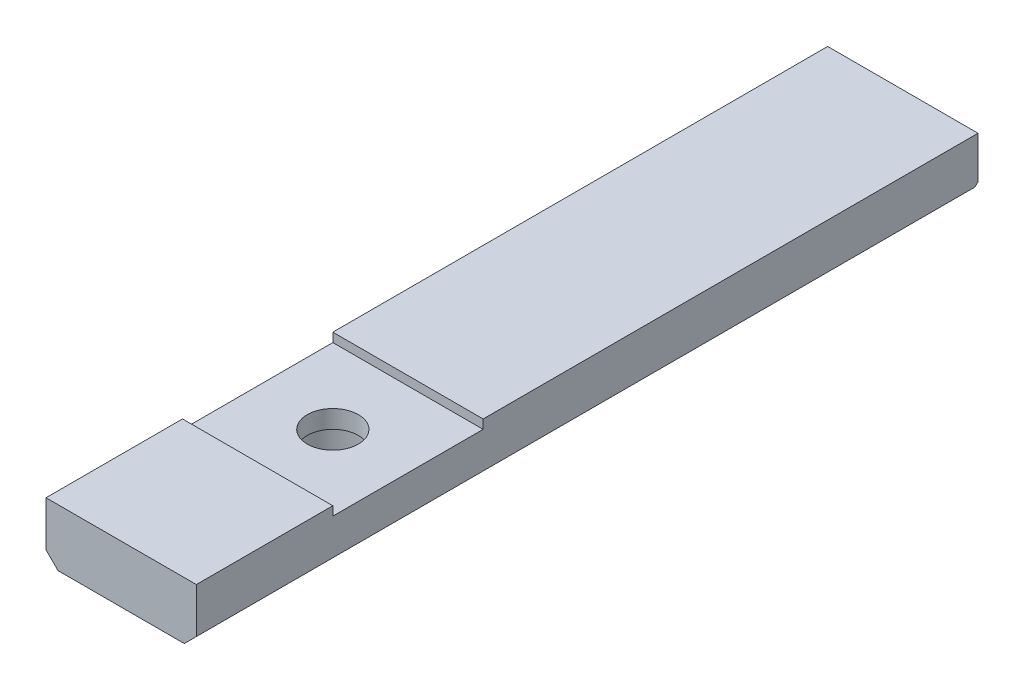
from build123d import *

# Parameters (mm, degrees)
BASE_EXTRUSION_DEPTH         = 130
CHANFREIN1_SIZE              = 0.5
ESQUISSE2_W                  = 25
ESQUISSE2_H                  = 1.5
ENL_V_MAT_EXTRU_1_DEPTH      = 133.880585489
ESQUISSE5_R                  = 4.25
ENL_V_MAT_EXTRU_2_DEPTH      = 131.981868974
ENL_V_MAT_EXTRU_3_DEPTH      = 140
ENL_V_MAT_EXTRU_3_DEPTH_BACK = 5.5
ESQUISSE6_R                  = 7
CHANFREIN2_SIZE              = 4


with BuildPart() as part:
    # Esquisse1 → Base-Extrusion (new body)
    with BuildSketch(Plane.XY):
        Polygon((-12.5, 0), (-6.1, 0), (-6.1, 1.5), (6.1, 1.5), (6.1, 0), (12.5, 0), (12.5, 11.5), (-12.5, 11.5), align=None)
    extrude(amount=BASE_EXTRUSION_DEPTH)

    # Chanfrein1
    chanfrein1_edges = [part.edges().sort_by_distance(p)[0] for p in [
        (6.1, 0, 65),
        (-6.1, 0, 65),
    ]]
    chamfer(chanfrein1_edges, length=CHANFREIN1_SIZE)

    # Esquisse2 → Enl_v. mat.-Extru.1 (cut, through all)
    with BuildSketch(Plane(origin=(12.5, 0, 0), x_dir=(0, 0, -1), z_dir=(1, 0, 0))):
        Polygon((-130, 2), (-128, 0), (-130, 0), align=None)
        Polygon((0, 4.5), (-4.5, 0), (0, 0), align=None)
        with Locations((-94.8, 10.75)):
            Rectangle(ESQUISSE2_W, ESQUISSE2_H)
    extrude(amount=-ENL_V_MAT_EXTRU_1_DEPTH, mode=Mode.SUBTRACT)

    # Esquisse5 → Enl_v. mat.-Extru.2 (cut, through all)
    with BuildSketch(Plane(origin=(0, 10, 0), x_dir=(-1, 0, 0), z_dir=(0, 1, 0))):
        with Locations(Location((0, 94.8, 0), (0, 0, 90))):
            Circle(ESQUISSE5_R)
    extrude(amount=-ENL_V_MAT_EXTRU_2_DEPTH, mode=Mode.SUBTRACT)

    # Esquisse6 → Enl_v. mat.-Extru.3 (cut, two sides: drawn at the far end of the back side and taken through both)
    with BuildSketch(Plane.XZ.offset(-1.5).offset(-ENL_V_MAT_EXTRU_3_DEPTH_BACK)):
        with Locations(Location((0, 94.8, 0), (0, 0, 270))):
            Circle(ESQUISSE6_R)
    extrude(amount=ENL_V_MAT_EXTRU_3_DEPTH + ENL_V_MAT_EXTRU_3_DEPTH_BACK, mode=Mode.SUBTRACT)

    # Chanfrein2
    chanfrein2_edges = [part.edges().sort_by_distance(p)[0] for p in [
        (12.5, 0, 66.25),
        (-12.5, 0, 66.25),
    ]]
    chamfer(chanfrein2_edges, length=CHANFREIN2_SIZE)


solid = part.part
